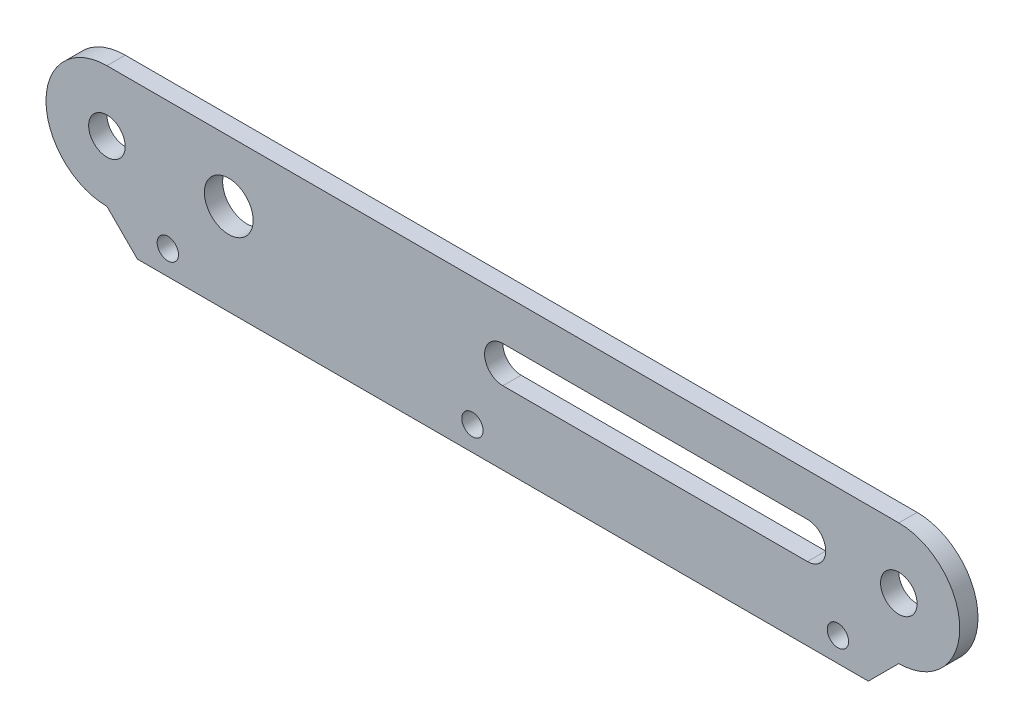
from build123d import *

# Parameters (mm, degrees)
SKETCH1_R           = 3
SKETCH1_R_2         = 4
SKETCH1_R_3         = 1.75
BOSS_EXTRUDE1_DEPTH = 3


with BuildPart() as part:
    # Sketch1 → Boss-Extrude1 (new body)
    with BuildSketch(Plane.XY):
        with BuildLine():
            Line((0, 10), (130, 10))
            ThreePointArc((130, 10), (140, 0), (130, -10))
            Line((130, -10), (125, -15))
            Line((125, -15), (5, -15))
            Line((5, -15), (0, -10))
            ThreePointArc((0, -10), (-10, 0), (0, 10))
        make_face()
        Circle(SKETCH1_R, mode=Mode.SUBTRACT)
        with Locations((20, 0)):
            Circle(SKETCH1_R_2, mode=Mode.SUBTRACT)
        with Locations((130, 0)):
            Circle(SKETCH1_R, mode=Mode.SUBTRACT)
        with Locations((10, -11)):
            Circle(SKETCH1_R_3, mode=Mode.SUBTRACT)
        with Locations((60, -11)):
            Circle(SKETCH1_R_3, mode=Mode.SUBTRACT)
        with Locations((120, -11)):
            Circle(SKETCH1_R_3, mode=Mode.SUBTRACT)
        with BuildLine():
            Line((65, 3), (115, 3))
            ThreePointArc((115, 3), (118, 0), (115, -3))
            Line((115, -3), (65, -3))
            ThreePointArc((65, -3), (62, 0), (65, 3))
        make_face(mode=Mode.SUBTRACT)
    extrude(amount=BOSS_EXTRUDE1_DEPTH)


solid = part.part
